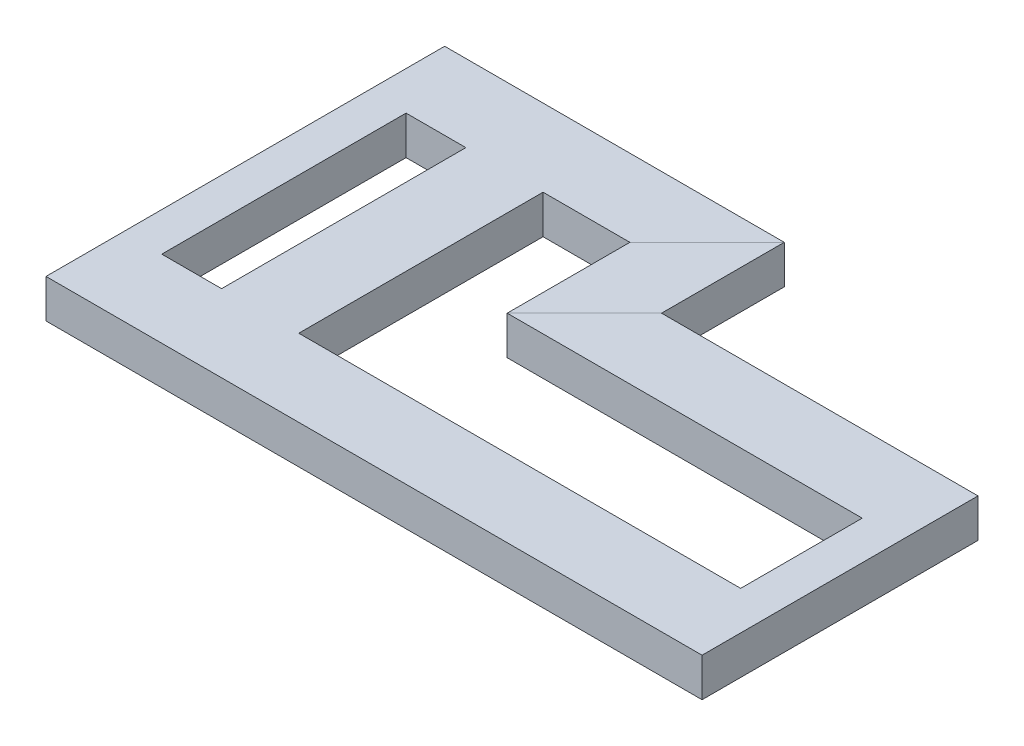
ISO-10303-21;
HEADER;
FILE_DESCRIPTION(('STEP AP214'),'2;1');
FILE_NAME('part.step','',(''),(''),'','','');
FILE_SCHEMA(('AUTOMOTIVE_DESIGN { 1 0 10303 214 1 1 1 1 }'));
ENDSEC;
DATA;
#1=APPLICATION_CONTEXT('core data for automotive mechanical design processes');
#2=APPLICATION_PROTOCOL_DEFINITION('international standard','automotive_design',2000,#1);
#3=PRODUCT_CONTEXT('',#1,'mechanical');
#4=PRODUCT('Part','Part','',(#3));
#5=PRODUCT_RELATED_PRODUCT_CATEGORY('part','',(#4));
#6=PRODUCT_DEFINITION_FORMATION('','',#4);
#7=PRODUCT_DEFINITION_CONTEXT('part definition',#1,'design');
#8=PRODUCT_DEFINITION('design','',#6,#7);
#9=PRODUCT_DEFINITION_SHAPE('','',#8);
#10=(LENGTH_UNIT() NAMED_UNIT(*) SI_UNIT(.MILLI.,.METRE.));
#11=(NAMED_UNIT(*) PLANE_ANGLE_UNIT() SI_UNIT($,.RADIAN.));
#12=(NAMED_UNIT(*) SI_UNIT($,.STERADIAN.) SOLID_ANGLE_UNIT());
#13=UNCERTAINTY_MEASURE_WITH_UNIT(LENGTH_MEASURE(1.E-05),#10,'distance_accuracy_value','');
#14=(GEOMETRIC_REPRESENTATION_CONTEXT(3) GLOBAL_UNCERTAINTY_ASSIGNED_CONTEXT((#13)) GLOBAL_UNIT_ASSIGNED_CONTEXT((#10,
#11,#12)) REPRESENTATION_CONTEXT('',''));
#15=CARTESIAN_POINT('',(0.,0.,0.));
#16=DIRECTION('',(0.,0.,1.));
#17=DIRECTION('',(1.,0.,0.));
#18=AXIS2_PLACEMENT_3D('',#15,#16,#17);
#19=CARTESIAN_POINT('',(-1700.,-100.,-100.));
#20=DIRECTION('',(0.,0.,-1.));
#21=DIRECTION('',(-1.,0.,0.));
#22=AXIS2_PLACEMENT_3D('',#19,#20,#21);
#23=PLANE('',#22);
#24=DIRECTION('',(1.,0.,0.));
#25=VECTOR('',#24,1.);
#26=CARTESIAN_POINT('',(-1700.,-100.,-100.));
#27=LINE('',#26,#25);
#28=CARTESIAN_POINT('',(-1245.,-100.,-100.));
#29=VERTEX_POINT('',#28);
#30=CARTESIAN_POINT('',(-100.,-100.,-99.9999999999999));
#31=VERTEX_POINT('',#30);
#32=EDGE_CURVE('E605',#29,#31,#27,.T.);
#33=ORIENTED_EDGE('',*,*,#32,.F.);
#34=DIRECTION('',(0.,-1.,0.));
#35=VECTOR('',#34,1.);
#36=CARTESIAN_POINT('',(-1245.,0.,-100.));
#37=LINE('',#36,#35);
#38=CARTESIAN_POINT('',(-1245.,0.,-100.));
#39=VERTEX_POINT('',#38);
#40=EDGE_CURVE('E53',#39,#29,#37,.T.);
#41=ORIENTED_EDGE('',*,*,#40,.F.);
#42=DIRECTION('',(1.,0.,0.));
#43=VECTOR('',#42,1.);
#44=CARTESIAN_POINT('',(-1700.,0.,-100.));
#45=LINE('',#44,#43);
#46=CARTESIAN_POINT('',(-100.,0.,-100.));
#47=VERTEX_POINT('',#46);
#48=EDGE_CURVE('E600',#39,#47,#45,.T.);
#49=ORIENTED_EDGE('',*,*,#48,.T.);
#50=DIRECTION('',(0.,1.,0.));
#51=VECTOR('',#50,1.);
#52=CARTESIAN_POINT('',(-100.,-100.,-100.));
#53=LINE('',#52,#51);
#54=EDGE_CURVE('E388',#31,#47,#53,.T.);
#55=ORIENTED_EDGE('',*,*,#54,.F.);
#56=EDGE_LOOP('',(#33,#41,#49,#55));
#57=FACE_BOUND('',#56,.T.);
#58=ADVANCED_FACE('F35',(#57),#23,.T.);
#59=CARTESIAN_POINT('',(-1600.,0.,-100.));
#60=VERTEX_POINT('',#59);
#61=CARTESIAN_POINT('',(-1445.,0.,-100.));
#62=VERTEX_POINT('',#61);
#63=EDGE_CURVE('E598',#60,#62,#45,.T.);
#64=ORIENTED_EDGE('',*,*,#63,.T.);
#65=DIRECTION('',(0.,1.,0.));
#66=VECTOR('',#65,1.);
#67=CARTESIAN_POINT('',(-1445.,-100.,-100.));
#68=LINE('',#67,#66);
#69=CARTESIAN_POINT('',(-1445.,-100.,-100.));
#70=VERTEX_POINT('',#69);
#71=EDGE_CURVE('E320',#70,#62,#68,.T.);
#72=ORIENTED_EDGE('',*,*,#71,.F.);
#73=CARTESIAN_POINT('',(-1600.,-100.,-100.));
#74=VERTEX_POINT('',#73);
#75=EDGE_CURVE('E601',#74,#70,#27,.T.);
#76=ORIENTED_EDGE('',*,*,#75,.F.);
#77=DIRECTION('',(0.,1.,0.));
#78=VECTOR('',#77,1.);
#79=CARTESIAN_POINT('',(-1600.,0.,-100.));
#80=LINE('',#79,#78);
#81=EDGE_CURVE('E547',#74,#60,#80,.T.);
#82=ORIENTED_EDGE('',*,*,#81,.T.);
#83=EDGE_LOOP('',(#64,#72,#76,#82));
#84=FACE_BOUND('',#83,.T.);
#85=ADVANCED_FACE('F645',(#84),#23,.T.);
#86=DIRECTION('',(-1.,0.,0.));
#87=VECTOR('',#86,1.);
#88=CARTESIAN_POINT('',(-1435.,-10.,-100.));
#89=LINE('',#88,#87);
#90=CARTESIAN_POINT('',(-1255.,-10.,-100.));
#91=VERTEX_POINT('',#90);
#92=CARTESIAN_POINT('',(-1435.,-10.,-100.));
#93=VERTEX_POINT('',#92);
#94=EDGE_CURVE('E806',#91,#93,#89,.T.);
#95=ORIENTED_EDGE('',*,*,#94,.F.);
#96=DIRECTION('',(0.,1.,0.));
#97=VECTOR('',#96,1.);
#98=CARTESIAN_POINT('',(-1255.,-10.,-100.));
#99=LINE('',#98,#97);
#100=CARTESIAN_POINT('',(-1255.,-100.,-100.));
#101=VERTEX_POINT('',#100);
#102=EDGE_CURVE('E802',#101,#91,#99,.T.);
#103=ORIENTED_EDGE('',*,*,#102,.F.);
#104=CARTESIAN_POINT('',(-1435.,-100.,-100.));
#105=VERTEX_POINT('',#104);
#106=EDGE_CURVE('E604',#105,#101,#27,.T.);
#107=ORIENTED_EDGE('',*,*,#106,.F.);
#108=DIRECTION('',(0.,-1.,0.));
#109=VECTOR('',#108,1.);
#110=CARTESIAN_POINT('',(-1435.,-100.,-100.));
#111=LINE('',#110,#109);
#112=EDGE_CURVE('E809',#93,#105,#111,.T.);
#113=ORIENTED_EDGE('',*,*,#112,.F.);
#114=EDGE_LOOP('',(#95,#103,#107,#113));
#115=FACE_BOUND('',#114,.T.);
#116=ADVANCED_FACE('F652',(#115),#23,.T.);
#117=CARTESIAN_POINT('',(-820.,-100.,-733.));
#118=DIRECTION('',(0.,0.,-1.));
#119=DIRECTION('',(-1.,0.,0.));
#120=AXIS2_PLACEMENT_3D('',#117,#118,#119);
#121=PLANE('',#120);
#122=DIRECTION('',(0.,-1.,0.));
#123=VECTOR('',#122,1.);
#124=CARTESIAN_POINT('',(-1245.,0.,-733.000000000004));
#125=LINE('',#124,#123);
#126=CARTESIAN_POINT('',(-1245.,0.,-733.));
#127=VERTEX_POINT('',#126);
#128=CARTESIAN_POINT('',(-1245.,-100.,-733.));
#129=VERTEX_POINT('',#128);
#130=EDGE_CURVE('E316',#127,#129,#125,.T.);
#131=ORIENTED_EDGE('',*,*,#130,.T.);
#132=DIRECTION('',(-1.,0.,0.));
#133=VECTOR('',#132,1.);
#134=CARTESIAN_POINT('',(-820.,-100.,-733.));
#135=LINE('',#134,#133);
#136=CARTESIAN_POINT('',(-1020.,-100.,-733.));
#137=VERTEX_POINT('',#136);
#138=EDGE_CURVE('E497',#137,#129,#135,.T.);
#139=ORIENTED_EDGE('',*,*,#138,.F.);
#140=DIRECTION('',(0.,1.,0.));
#141=VECTOR('',#140,1.);
#142=CARTESIAN_POINT('',(-1020.,-100.,-733.));
#143=LINE('',#142,#141);
#144=CARTESIAN_POINT('',(-1020.,0.,-733.));
#145=VERTEX_POINT('',#144);
#146=EDGE_CURVE('E479',#137,#145,#143,.T.);
#147=ORIENTED_EDGE('',*,*,#146,.T.);
#148=DIRECTION('',(-1.,0.,0.));
#149=VECTOR('',#148,1.);
#150=CARTESIAN_POINT('',(-820.,0.,-733.));
#151=LINE('',#150,#149);
#152=EDGE_CURVE('E306',#145,#127,#151,.T.);
#153=ORIENTED_EDGE('',*,*,#152,.T.);
#154=EDGE_LOOP('',(#131,#139,#147,#153));
#155=FACE_BOUND('',#154,.T.);
#156=ADVANCED_FACE('F760',(#155),#121,.F.);
#157=DIRECTION('',(0.,1.,0.));
#158=VECTOR('',#157,1.);
#159=CARTESIAN_POINT('',(-1445.,-100.,-733.000000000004));
#160=LINE('',#159,#158);
#161=CARTESIAN_POINT('',(-1445.,-100.,-733.));
#162=VERTEX_POINT('',#161);
#163=CARTESIAN_POINT('',(-1445.,0.,-733.000000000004));
#164=VERTEX_POINT('',#163);
#165=EDGE_CURVE('E310',#162,#164,#160,.T.);
#166=ORIENTED_EDGE('',*,*,#165,.T.);
#167=CARTESIAN_POINT('',(-1600.,0.,-733.));
#168=VERTEX_POINT('',#167);
#169=EDGE_CURVE('E295',#164,#168,#151,.T.);
#170=ORIENTED_EDGE('',*,*,#169,.T.);
#171=DIRECTION('',(0.,-1.,0.));
#172=VECTOR('',#171,1.);
#173=CARTESIAN_POINT('',(-1600.,0.,-733.));
#174=LINE('',#173,#172);
#175=CARTESIAN_POINT('',(-1600.,-100.,-733.));
#176=VERTEX_POINT('',#175);
#177=EDGE_CURVE('E566',#168,#176,#174,.T.);
#178=ORIENTED_EDGE('',*,*,#177,.T.);
#179=EDGE_CURVE('E312',#162,#176,#135,.T.);
#180=ORIENTED_EDGE('',*,*,#179,.F.);
#181=EDGE_LOOP('',(#166,#170,#178,#180));
#182=FACE_BOUND('',#181,.T.);
#183=ADVANCED_FACE('F311',(#182),#121,.F.);
#184=DIRECTION('',(0.,1.,0.));
#185=VECTOR('',#184,1.);
#186=CARTESIAN_POINT('',(-1255.,-10.,-733.000000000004));
#187=LINE('',#186,#185);
#188=CARTESIAN_POINT('',(-1255.,-100.,-733.));
#189=VERTEX_POINT('',#188);
#190=CARTESIAN_POINT('',(-1255.,-9.99999999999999,-733.));
#191=VERTEX_POINT('',#190);
#192=EDGE_CURVE('E61',#189,#191,#187,.T.);
#193=ORIENTED_EDGE('',*,*,#192,.T.);
#194=DIRECTION('',(-1.,0.,0.));
#195=VECTOR('',#194,1.);
#196=CARTESIAN_POINT('',(-1434.99999999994,-10.,-733.000000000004));
#197=LINE('',#196,#195);
#198=CARTESIAN_POINT('',(-1435.,-10.,-733.));
#199=VERTEX_POINT('',#198);
#200=EDGE_CURVE('E331',#191,#199,#197,.T.);
#201=ORIENTED_EDGE('',*,*,#200,.T.);
#202=DIRECTION('',(0.,-1.,0.));
#203=VECTOR('',#202,1.);
#204=CARTESIAN_POINT('',(-1435.,-100.,-733.000000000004));
#205=LINE('',#204,#203);
#206=CARTESIAN_POINT('',(-1435.,-100.,-733.));
#207=VERTEX_POINT('',#206);
#208=EDGE_CURVE('E333',#199,#207,#205,.T.);
#209=ORIENTED_EDGE('',*,*,#208,.T.);
#210=EDGE_CURVE('E536',#189,#207,#135,.T.);
#211=ORIENTED_EDGE('',*,*,#210,.F.);
#212=EDGE_LOOP('',(#193,#201,#209,#211));
#213=FACE_BOUND('',#212,.T.);
#214=ADVANCED_FACE('F944',(#213),#121,.F.);
#215=CARTESIAN_POINT('',(-1700.,-100.,-90.));
#216=DIRECTION('',(0.,0.,1.));
#217=DIRECTION('',(1.,0.,0.));
#218=AXIS2_PLACEMENT_3D('',#215,#216,#217);
#219=PLANE('',#218);
#220=DIRECTION('',(0.,1.,0.));
#221=VECTOR('',#220,1.);
#222=CARTESIAN_POINT('',(-5.,-10.,-90.));
#223=LINE('',#222,#221);
#224=CARTESIAN_POINT('',(-5.,-100.,-90.));
#225=VERTEX_POINT('',#224);
#226=CARTESIAN_POINT('',(-5.,-10.,-90.));
#227=VERTEX_POINT('',#226);
#228=EDGE_CURVE('E335',#225,#227,#223,.T.);
#229=ORIENTED_EDGE('',*,*,#228,.T.);
#230=DIRECTION('',(1.,0.,0.));
#231=VECTOR('',#230,1.);
#232=CARTESIAN_POINT('',(-1700.,-10.,-90.));
#233=LINE('',#232,#231);
#234=CARTESIAN_POINT('',(-1695.,-10.,-90.));
#235=VERTEX_POINT('',#234);
#236=EDGE_CURVE('E609',#235,#227,#233,.T.);
#237=ORIENTED_EDGE('',*,*,#236,.F.);
#238=DIRECTION('',(0.,1.,0.));
#239=VECTOR('',#238,1.);
#240=CARTESIAN_POINT('',(-1695.,-100.,-90.));
#241=LINE('',#240,#239);
#242=CARTESIAN_POINT('',(-1695.,-100.,-90.));
#243=VERTEX_POINT('',#242);
#244=EDGE_CURVE('E362',#243,#235,#241,.T.);
#245=ORIENTED_EDGE('',*,*,#244,.F.);
#246=DIRECTION('',(1.,0.,0.));
#247=VECTOR('',#246,1.);
#248=CARTESIAN_POINT('',(-1700.,-100.,-90.));
#249=LINE('',#248,#247);
#250=EDGE_CURVE('E606',#243,#225,#249,.T.);
#251=ORIENTED_EDGE('',*,*,#250,.T.);
#252=EDGE_LOOP('',(#229,#237,#245,#251));
#253=FACE_BOUND('',#252,.T.);
#254=ADVANCED_FACE('F628',(#253),#219,.T.);
#255=CARTESIAN_POINT('',(-1700.,-10.,90.));
#256=DIRECTION('',(0.,-1.,0.));
#257=DIRECTION('',(0.,0.,-1.));
#258=AXIS2_PLACEMENT_3D('',#255,#256,#257);
#259=PLANE('',#258);
#260=DIRECTION('',(0.,0.,1.));
#261=VECTOR('',#260,1.);
#262=CARTESIAN_POINT('',(-5.,-10.,-90.));
#263=LINE('',#262,#261);
#264=CARTESIAN_POINT('',(-5.,-10.,90.));
#265=VERTEX_POINT('',#264);
#266=EDGE_CURVE('E338',#227,#265,#263,.T.);
#267=ORIENTED_EDGE('',*,*,#266,.T.);
#268=DIRECTION('',(1.,0.,0.));
#269=VECTOR('',#268,1.);
#270=CARTESIAN_POINT('',(-1700.,-10.,90.));
#271=LINE('',#270,#269);
#272=CARTESIAN_POINT('',(-1695.,-10.,90.));
#273=VERTEX_POINT('',#272);
#274=EDGE_CURVE('E611',#273,#265,#271,.T.);
#275=ORIENTED_EDGE('',*,*,#274,.F.);
#276=DIRECTION('',(0.,0.,-1.));
#277=VECTOR('',#276,1.);
#278=CARTESIAN_POINT('',(-1695.,-10.,90.));
#279=LINE('',#278,#277);
#280=EDGE_CURVE('E365',#273,#235,#279,.T.);
#281=ORIENTED_EDGE('',*,*,#280,.T.);
#282=ORIENTED_EDGE('',*,*,#236,.T.);
#283=EDGE_LOOP('',(#267,#275,#281,#282));
#284=FACE_BOUND('',#283,.T.);
#285=ADVANCED_FACE('F624',(#284),#259,.T.);
#286=CARTESIAN_POINT('',(-1700.,-100.,90.));
#287=DIRECTION('',(0.,0.,-1.));
#288=DIRECTION('',(-1.,0.,0.));
#289=AXIS2_PLACEMENT_3D('',#286,#287,#288);
#290=PLANE('',#289);
#291=DIRECTION('',(0.,-1.,0.));
#292=VECTOR('',#291,1.);
#293=CARTESIAN_POINT('',(-5.,-10.,90.));
#294=LINE('',#293,#292);
#295=CARTESIAN_POINT('',(-5.,-100.,90.));
#296=VERTEX_POINT('',#295);
#297=EDGE_CURVE('E341',#265,#296,#294,.T.);
#298=ORIENTED_EDGE('',*,*,#297,.T.);
#299=DIRECTION('',(1.,0.,0.));
#300=VECTOR('',#299,1.);
#301=CARTESIAN_POINT('',(-1700.,-100.,90.));
#302=LINE('',#301,#300);
#303=CARTESIAN_POINT('',(-1695.,-100.,90.));
#304=VERTEX_POINT('',#303);
#305=EDGE_CURVE('E39',#304,#296,#302,.T.);
#306=ORIENTED_EDGE('',*,*,#305,.F.);
#307=DIRECTION('',(0.,1.,0.));
#308=VECTOR('',#307,1.);
#309=CARTESIAN_POINT('',(-1695.,-100.,90.));
#310=LINE('',#309,#308);
#311=EDGE_CURVE('E367',#304,#273,#310,.T.);
#312=ORIENTED_EDGE('',*,*,#311,.T.);
#313=ORIENTED_EDGE('',*,*,#274,.T.);
#314=EDGE_LOOP('',(#298,#306,#312,#313));
#315=FACE_BOUND('',#314,.T.);
#316=ADVANCED_FACE('F37',(#315),#290,.T.);
#317=CARTESIAN_POINT('',(-820.,-100.,-743.));
#318=DIRECTION('',(0.,0.,1.));
#319=DIRECTION('',(1.,0.,0.));
#320=AXIS2_PLACEMENT_3D('',#317,#318,#319);
#321=PLANE('',#320);
#322=DIRECTION('',(0.,1.,0.));
#323=VECTOR('',#322,1.);
#324=CARTESIAN_POINT('',(-1695.,-100.,-743.));
#325=LINE('',#324,#323);
#326=CARTESIAN_POINT('',(-1695.,-100.,-743.));
#327=VERTEX_POINT('',#326);
#328=CARTESIAN_POINT('',(-1695.,-10.,-743.));
#329=VERTEX_POINT('',#328);
#330=EDGE_CURVE('E369',#327,#329,#325,.T.);
#331=ORIENTED_EDGE('',*,*,#330,.T.);
#332=DIRECTION('',(-1.,0.,0.));
#333=VECTOR('',#332,1.);
#334=CARTESIAN_POINT('',(-820.,-10.,-743.));
#335=LINE('',#334,#333);
#336=CARTESIAN_POINT('',(-1010.,-10.,-743.));
#337=VERTEX_POINT('',#336);
#338=EDGE_CURVE('E528',#337,#329,#335,.T.);
#339=ORIENTED_EDGE('',*,*,#338,.F.);
#340=DIRECTION('',(0.,-1.,0.));
#341=VECTOR('',#340,1.);
#342=CARTESIAN_POINT('',(-1010.,-100.,-743.));
#343=LINE('',#342,#341);
#344=CARTESIAN_POINT('',(-1010.,-100.,-743.));
#345=VERTEX_POINT('',#344);
#346=EDGE_CURVE('E485',#337,#345,#343,.T.);
#347=ORIENTED_EDGE('',*,*,#346,.T.);
#348=DIRECTION('',(-1.,0.,0.));
#349=VECTOR('',#348,1.);
#350=CARTESIAN_POINT('',(-820.,-100.,-743.));
#351=LINE('',#350,#349);
#352=EDGE_CURVE('E531',#345,#327,#351,.T.);
#353=ORIENTED_EDGE('',*,*,#352,.T.);
#354=EDGE_LOOP('',(#331,#339,#347,#353));
#355=FACE_BOUND('',#354,.T.);
#356=ADVANCED_FACE('F748',(#355),#321,.F.);
#357=CARTESIAN_POINT('',(-820.,-10.,-743.));
#358=DIRECTION('',(0.,1.,0.));
#359=DIRECTION('',(0.,0.,1.));
#360=AXIS2_PLACEMENT_3D('',#357,#358,#359);
#361=PLANE('',#360);
#362=DIRECTION('',(0.,0.,-1.));
#363=VECTOR('',#362,1.);
#364=CARTESIAN_POINT('',(-1695.,-10.,-743.));
#365=LINE('',#364,#363);
#366=CARTESIAN_POINT('',(-1695.,-10.,-923.));
#367=VERTEX_POINT('',#366);
#368=EDGE_CURVE('E372',#329,#367,#365,.T.);
#369=ORIENTED_EDGE('',*,*,#368,.T.);
#370=DIRECTION('',(-1.,0.,0.));
#371=VECTOR('',#370,1.);
#372=CARTESIAN_POINT('',(-820.,-10.,-923.));
#373=LINE('',#372,#371);
#374=CARTESIAN_POINT('',(-830.,-10.,-923.));
#375=VERTEX_POINT('',#374);
#376=EDGE_CURVE('E525',#375,#367,#373,.T.);
#377=ORIENTED_EDGE('',*,*,#376,.F.);
#378=DIRECTION('',(-0.707106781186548,0.,0.707106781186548));
#379=VECTOR('',#378,1.);
#380=CARTESIAN_POINT('',(-1184.05,-10.,-568.95));
#381=LINE('',#380,#379);
#382=EDGE_CURVE('E482',#375,#337,#381,.T.);
#383=ORIENTED_EDGE('',*,*,#382,.T.);
#384=ORIENTED_EDGE('',*,*,#338,.T.);
#385=EDGE_LOOP('',(#369,#377,#383,#384));
#386=FACE_BOUND('',#385,.T.);
#387=ADVANCED_FACE('F751',(#386),#361,.F.);
#388=CARTESIAN_POINT('',(-820.,-10.,-923.));
#389=DIRECTION('',(0.,0.,-1.));
#390=DIRECTION('',(-1.,0.,0.));
#391=AXIS2_PLACEMENT_3D('',#388,#389,#390);
#392=PLANE('',#391);
#393=DIRECTION('',(0.,1.,0.));
#394=VECTOR('',#393,1.);
#395=CARTESIAN_POINT('',(-1695.,-100.,-923.));
#396=LINE('',#395,#394);
#397=CARTESIAN_POINT('',(-1695.,-100.,-923.));
#398=VERTEX_POINT('',#397);
#399=EDGE_CURVE('E375',#398,#367,#396,.T.);
#400=ORIENTED_EDGE('',*,*,#399,.F.);
#401=DIRECTION('',(-1.,0.,0.));
#402=VECTOR('',#401,1.);
#403=CARTESIAN_POINT('',(-820.,-100.,-923.));
#404=LINE('',#403,#402);
#405=CARTESIAN_POINT('',(-830.,-100.,-923.));
#406=VERTEX_POINT('',#405);
#407=EDGE_CURVE('E521',#406,#398,#404,.T.);
#408=ORIENTED_EDGE('',*,*,#407,.F.);
#409=DIRECTION('',(0.,1.,0.));
#410=VECTOR('',#409,1.);
#411=CARTESIAN_POINT('',(-830.,-10.,-923.));
#412=LINE('',#411,#410);
#413=EDGE_CURVE('E478',#406,#375,#412,.T.);
#414=ORIENTED_EDGE('',*,*,#413,.T.);
#415=ORIENTED_EDGE('',*,*,#376,.T.);
#416=EDGE_LOOP('',(#400,#408,#414,#415));
#417=FACE_BOUND('',#416,.T.);
#418=ADVANCED_FACE('F755',(#417),#392,.F.);
#419=CARTESIAN_POINT('',(0.,-100.,-415.));
#420=DIRECTION('',(0.,0.,-1.));
#421=DIRECTION('',(-1.,0.,0.));
#422=AXIS2_PLACEMENT_3D('',#419,#420,#421);
#423=PLANE('',#422);
#424=DIRECTION('',(0.,-1.,0.));
#425=VECTOR('',#424,1.);
#426=CARTESIAN_POINT('',(-100.,-100.,-415.));
#427=LINE('',#426,#425);
#428=CARTESIAN_POINT('',(-100.,0.,-415.));
#429=VERTEX_POINT('',#428);
#430=CARTESIAN_POINT('',(-100.,-100.,-415.));
#431=VERTEX_POINT('',#430);
#432=EDGE_CURVE('E380',#429,#431,#427,.T.);
#433=ORIENTED_EDGE('',*,*,#432,.F.);
#434=DIRECTION('',(-1.,0.,0.));
#435=VECTOR('',#434,1.);
#436=CARTESIAN_POINT('',(0.,0.,-415.));
#437=LINE('',#436,#435);
#438=CARTESIAN_POINT('',(-1020.,0.,-415.));
#439=VERTEX_POINT('',#438);
#440=EDGE_CURVE('E462',#429,#439,#437,.T.);
#441=ORIENTED_EDGE('',*,*,#440,.T.);
#442=DIRECTION('',(0.,1.,0.));
#443=VECTOR('',#442,1.);
#444=CARTESIAN_POINT('',(-1020.,-100.,-415.));
#445=LINE('',#444,#443);
#446=CARTESIAN_POINT('',(-1020.,-100.,-415.));
#447=VERTEX_POINT('',#446);
#448=EDGE_CURVE('E438',#447,#439,#445,.T.);
#449=ORIENTED_EDGE('',*,*,#448,.F.);
#450=DIRECTION('',(-1.,0.,0.));
#451=VECTOR('',#450,1.);
#452=CARTESIAN_POINT('',(0.,-100.,-415.));
#453=LINE('',#452,#451);
#454=EDGE_CURVE('E445',#431,#447,#453,.T.);
#455=ORIENTED_EDGE('',*,*,#454,.F.);
#456=EDGE_LOOP('',(#433,#441,#449,#455));
#457=FACE_BOUND('',#456,.T.);
#458=ADVANCED_FACE('F712',(#457),#423,.F.);
#459=CARTESIAN_POINT('',(-1700.,-100.,100.));
#460=DIRECTION('',(0.,0.,1.));
#461=DIRECTION('',(1.,0.,0.));
#462=AXIS2_PLACEMENT_3D('',#459,#460,#461);
#463=PLANE('',#462);
#464=DIRECTION('',(0.,-1.,0.));
#465=VECTOR('',#464,1.);
#466=CARTESIAN_POINT('',(0.,-100.,100.));
#467=LINE('',#466,#465);
#468=CARTESIAN_POINT('',(0.,0.,100.));
#469=VERTEX_POINT('',#468);
#470=CARTESIAN_POINT('',(0.,-100.,100.));
#471=VERTEX_POINT('',#470);
#472=EDGE_CURVE('E585',#469,#471,#467,.T.);
#473=ORIENTED_EDGE('',*,*,#472,.F.);
#474=DIRECTION('',(1.,0.,0.));
#475=VECTOR('',#474,1.);
#476=CARTESIAN_POINT('',(-1700.,0.,100.));
#477=LINE('',#476,#475);
#478=CARTESIAN_POINT('',(-1700.,0.,100.));
#479=VERTEX_POINT('',#478);
#480=EDGE_CURVE('E45',#479,#469,#477,.T.);
#481=ORIENTED_EDGE('',*,*,#480,.F.);
#482=DIRECTION('',(0.,-1.,0.));
#483=VECTOR('',#482,1.);
#484=CARTESIAN_POINT('',(-1700.,-100.,100.));
#485=LINE('',#484,#483);
#486=CARTESIAN_POINT('',(-1700.,-100.,100.));
#487=VERTEX_POINT('',#486);
#488=EDGE_CURVE('E588',#479,#487,#485,.T.);
#489=ORIENTED_EDGE('',*,*,#488,.T.);
#490=DIRECTION('',(1.,0.,0.));
#491=VECTOR('',#490,1.);
#492=CARTESIAN_POINT('',(-1700.,-100.,100.));
#493=LINE('',#492,#491);
#494=EDGE_CURVE('E11',#487,#471,#493,.T.);
#495=ORIENTED_EDGE('',*,*,#494,.T.);
#496=EDGE_LOOP('',(#473,#481,#489,#495));
#497=FACE_BOUND('',#496,.T.);
#498=ADVANCED_FACE('F787',(#497),#463,.T.);
#499=CARTESIAN_POINT('',(-1700.,0.,100.));
#500=DIRECTION('',(0.,1.,0.));
#501=DIRECTION('',(0.,0.,1.));
#502=AXIS2_PLACEMENT_3D('',#499,#500,#501);
#503=PLANE('',#502);
#504=ORIENTED_EDGE('',*,*,#48,.F.);
#505=DIRECTION('',(0.,0.,1.));
#506=VECTOR('',#505,1.);
#507=CARTESIAN_POINT('',(-1245.,0.,-500000.));
#508=LINE('',#507,#506);
#509=EDGE_CURVE('E322',#127,#39,#508,.T.);
#510=ORIENTED_EDGE('',*,*,#509,.F.);
#511=ORIENTED_EDGE('',*,*,#152,.F.);
#512=DIRECTION('',(0.707106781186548,0.,-0.707106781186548));
#513=VECTOR('',#512,1.);
#514=CARTESIAN_POINT('',(-1189.05,0.,-563.95));
#515=LINE('',#514,#513);
#516=CARTESIAN_POINT('',(-820.,0.,-933.));
#517=VERTEX_POINT('',#516);
#518=EDGE_CURVE('E494',#145,#517,#515,.T.);
#519=ORIENTED_EDGE('',*,*,#518,.T.);
#520=DIRECTION('',(-1.,0.,0.));
#521=VECTOR('',#520,1.);
#522=CARTESIAN_POINT('',(-820.,0.,-933.));
#523=LINE('',#522,#521);
#524=CARTESIAN_POINT('',(-1700.,0.,-933.));
#525=VERTEX_POINT('',#524);
#526=EDGE_CURVE('E513',#517,#525,#523,.T.);
#527=ORIENTED_EDGE('',*,*,#526,.T.);
#528=DIRECTION('',(0.,0.,1.));
#529=VECTOR('',#528,1.);
#530=CARTESIAN_POINT('',(-1700.,0.,100.));
#531=LINE('',#530,#529);
#532=EDGE_CURVE('E584',#525,#479,#531,.T.);
#533=ORIENTED_EDGE('',*,*,#532,.T.);
#534=ORIENTED_EDGE('',*,*,#480,.T.);
#535=DIRECTION('',(0.,0.,1.));
#536=VECTOR('',#535,1.);
#537=CARTESIAN_POINT('',(0.,0.,100.));
#538=LINE('',#537,#536);
#539=CARTESIAN_POINT('',(0.,0.,-615.));
#540=VERTEX_POINT('',#539);
#541=EDGE_CURVE('E592',#540,#469,#538,.T.);
#542=ORIENTED_EDGE('',*,*,#541,.F.);
#543=DIRECTION('',(-1.,0.,0.));
#544=VECTOR('',#543,1.);
#545=CARTESIAN_POINT('',(0.,0.,-615.));
#546=LINE('',#545,#544);
#547=CARTESIAN_POINT('',(-820.,0.,-615.));
#548=VERTEX_POINT('',#547);
#549=EDGE_CURVE('E456',#540,#548,#546,.T.);
#550=ORIENTED_EDGE('',*,*,#549,.T.);
#551=DIRECTION('',(0.707106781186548,0.,-0.707106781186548));
#552=VECTOR('',#551,1.);
#553=CARTESIAN_POINT('',(-510.,0.,-925.));
#554=LINE('',#553,#552);
#555=EDGE_CURVE('E435',#439,#548,#554,.T.);
#556=ORIENTED_EDGE('',*,*,#555,.F.);
#557=ORIENTED_EDGE('',*,*,#440,.F.);
#558=DIRECTION('',(0.,0.,-1.));
#559=VECTOR('',#558,1.);
#560=CARTESIAN_POINT('',(-100.,0.,41.4213562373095));
#561=LINE('',#560,#559);
#562=EDGE_CURVE('E384',#47,#429,#561,.T.);
#563=ORIENTED_EDGE('',*,*,#562,.F.);
#564=EDGE_LOOP('',(#504,#510,#511,#519,#527,#533,#534,#542,#550,#556,#557,#563));
#565=FACE_BOUND('',#564,.T.);
#566=DIRECTION('',(0.,0.,1.));
#567=VECTOR('',#566,1.);
#568=CARTESIAN_POINT('',(-1445.,0.,-500000.));
#569=LINE('',#568,#567);
#570=EDGE_CURVE('E300',#164,#62,#569,.T.);
#571=ORIENTED_EDGE('',*,*,#570,.T.);
#572=ORIENTED_EDGE('',*,*,#63,.F.);
#573=DIRECTION('',(0.,0.,-1.));
#574=VECTOR('',#573,1.);
#575=CARTESIAN_POINT('',(-1600.,0.,41.4213562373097));
#576=LINE('',#575,#574);
#577=EDGE_CURVE('E302',#60,#168,#576,.T.);
#578=ORIENTED_EDGE('',*,*,#577,.T.);
#579=ORIENTED_EDGE('',*,*,#169,.F.);
#580=EDGE_LOOP('',(#571,#572,#578,#579));
#581=FACE_BOUND('',#580,.T.);
#582=ADVANCED_FACE('F297',(#565,#581),#503,.T.);
#583=CARTESIAN_POINT('',(-1700.,-100.,-100.));
#584=DIRECTION('',(0.,-1.,0.));
#585=DIRECTION('',(0.,0.,-1.));
#586=AXIS2_PLACEMENT_3D('',#583,#584,#585);
#587=PLANE('',#586);
#588=ORIENTED_EDGE('',*,*,#75,.T.);
#589=DIRECTION('',(0.,0.,1.));
#590=VECTOR('',#589,1.);
#591=CARTESIAN_POINT('',(-1445.,-100.,-500000.));
#592=LINE('',#591,#590);
#593=EDGE_CURVE('E315',#162,#70,#592,.T.);
#594=ORIENTED_EDGE('',*,*,#593,.F.);
#595=ORIENTED_EDGE('',*,*,#179,.T.);
#596=DIRECTION('',(0.,0.,-1.));
#597=VECTOR('',#596,1.);
#598=CARTESIAN_POINT('',(-1600.,-100.,41.4213562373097));
#599=LINE('',#598,#597);
#600=EDGE_CURVE('E576',#74,#176,#599,.T.);
#601=ORIENTED_EDGE('',*,*,#600,.F.);
#602=EDGE_LOOP('',(#588,#594,#595,#601));
#603=FACE_BOUND('',#602,.T.);
#604=ORIENTED_EDGE('',*,*,#106,.T.);
#605=DIRECTION('',(0.,0.,1.));
#606=VECTOR('',#605,1.);
#607=CARTESIAN_POINT('',(-1255.,-100.,-500000.));
#608=LINE('',#607,#606);
#609=EDGE_CURVE('E817',#189,#101,#608,.T.);
#610=ORIENTED_EDGE('',*,*,#609,.F.);
#611=ORIENTED_EDGE('',*,*,#210,.T.);
#612=DIRECTION('',(0.,0.,1.));
#613=VECTOR('',#612,1.);
#614=CARTESIAN_POINT('',(-1435.,-100.,-500000.));
#615=LINE('',#614,#613);
#616=EDGE_CURVE('E811',#207,#105,#615,.T.);
#617=ORIENTED_EDGE('',*,*,#616,.T.);
#618=EDGE_LOOP('',(#604,#610,#611,#617));
#619=FACE_BOUND('',#618,.T.);
#620=DIRECTION('',(0.,0.,-1.));
#621=VECTOR('',#620,1.);
#622=CARTESIAN_POINT('',(0.,-100.,-100.));
#623=LINE('',#622,#621);
#624=CARTESIAN_POINT('',(0.,-100.,-615.));
#625=VERTEX_POINT('',#624);
#626=EDGE_CURVE('E540',#471,#625,#623,.T.);
#627=ORIENTED_EDGE('',*,*,#626,.F.);
#628=ORIENTED_EDGE('',*,*,#494,.F.);
#629=DIRECTION('',(0.,0.,-1.));
#630=VECTOR('',#629,1.);
#631=CARTESIAN_POINT('',(-1700.,-100.,100.));
#632=LINE('',#631,#630);
#633=CARTESIAN_POINT('',(-1700.,-100.,-933.));
#634=VERTEX_POINT('',#633);
#635=EDGE_CURVE('E582',#487,#634,#632,.T.);
#636=ORIENTED_EDGE('',*,*,#635,.T.);
#637=DIRECTION('',(-1.,0.,0.));
#638=VECTOR('',#637,1.);
#639=CARTESIAN_POINT('',(-820.,-100.,-933.));
#640=LINE('',#639,#638);
#641=CARTESIAN_POINT('',(-820.,-100.,-933.));
#642=VERTEX_POINT('',#641);
#643=EDGE_CURVE('E519',#642,#634,#640,.T.);
#644=ORIENTED_EDGE('',*,*,#643,.F.);
#645=DIRECTION('',(-0.707106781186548,0.,0.707106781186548));
#646=VECTOR('',#645,1.);
#647=CARTESIAN_POINT('',(-1094.05,-100.,-658.95));
#648=LINE('',#647,#646);
#649=EDGE_CURVE('E475',#642,#406,#648,.T.);
#650=ORIENTED_EDGE('',*,*,#649,.T.);
#651=ORIENTED_EDGE('',*,*,#407,.T.);
#652=DIRECTION('',(0.,0.,-1.));
#653=VECTOR('',#652,1.);
#654=CARTESIAN_POINT('',(-1695.,-100.,-743.));
#655=LINE('',#654,#653);
#656=EDGE_CURVE('E377',#327,#398,#655,.T.);
#657=ORIENTED_EDGE('',*,*,#656,.F.);
#658=ORIENTED_EDGE('',*,*,#352,.F.);
#659=DIRECTION('',(-0.707106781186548,0.,0.707106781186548));
#660=VECTOR('',#659,1.);
#661=CARTESIAN_POINT('',(-1189.05,-100.,-563.95));
#662=LINE('',#661,#660);
#663=EDGE_CURVE('E488',#345,#137,#662,.T.);
#664=ORIENTED_EDGE('',*,*,#663,.T.);
#665=ORIENTED_EDGE('',*,*,#138,.T.);
#666=DIRECTION('',(0.,0.,1.));
#667=VECTOR('',#666,1.);
#668=CARTESIAN_POINT('',(-1245.,-100.,-500000.));
#669=LINE('',#668,#667);
#670=EDGE_CURVE('E324',#129,#29,#669,.T.);
#671=ORIENTED_EDGE('',*,*,#670,.T.);
#672=ORIENTED_EDGE('',*,*,#32,.T.);
#673=DIRECTION('',(0.,0.,-1.));
#674=VECTOR('',#673,1.);
#675=CARTESIAN_POINT('',(-100.,-100.,41.4213562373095));
#676=LINE('',#675,#674);
#677=EDGE_CURVE('E383',#31,#431,#676,.T.);
#678=ORIENTED_EDGE('',*,*,#677,.T.);
#679=ORIENTED_EDGE('',*,*,#454,.T.);
#680=DIRECTION('',(-0.707106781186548,0.,0.707106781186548));
#681=VECTOR('',#680,1.);
#682=CARTESIAN_POINT('',(-510.,-100.,-925.));
#683=LINE('',#682,#681);
#684=CARTESIAN_POINT('',(-1010.,-100.,-425.));
#685=VERTEX_POINT('',#684);
#686=EDGE_CURVE('E441',#685,#447,#683,.T.);
#687=ORIENTED_EDGE('',*,*,#686,.F.);
#688=DIRECTION('',(-1.,0.,0.));
#689=VECTOR('',#688,1.);
#690=CARTESIAN_POINT('',(0.,-100.,-425.));
#691=LINE('',#690,#689);
#692=CARTESIAN_POINT('',(-5.,-100.,-425.));
#693=VERTEX_POINT('',#692);
#694=EDGE_CURVE('E442',#693,#685,#691,.T.);
#695=ORIENTED_EDGE('',*,*,#694,.F.);
#696=DIRECTION('',(0.,0.,-1.));
#697=VECTOR('',#696,1.);
#698=CARTESIAN_POINT('',(-5.,-100.,-425.));
#699=LINE('',#698,#697);
#700=CARTESIAN_POINT('',(-5.,-100.,-605.));
#701=VERTEX_POINT('',#700);
#702=EDGE_CURVE('E350',#693,#701,#699,.T.);
#703=ORIENTED_EDGE('',*,*,#702,.T.);
#704=DIRECTION('',(-1.,0.,0.));
#705=VECTOR('',#704,1.);
#706=CARTESIAN_POINT('',(0.,-100.,-605.));
#707=LINE('',#706,#705);
#708=CARTESIAN_POINT('',(-830.,-100.,-605.));
#709=VERTEX_POINT('',#708);
#710=EDGE_CURVE('E451',#701,#709,#707,.T.);
#711=ORIENTED_EDGE('',*,*,#710,.T.);
#712=DIRECTION('',(-0.707106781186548,0.,0.707106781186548));
#713=VECTOR('',#712,1.);
#714=CARTESIAN_POINT('',(-415.,-100.,-1020.));
#715=LINE('',#714,#713);
#716=CARTESIAN_POINT('',(-820.,-100.,-615.));
#717=VERTEX_POINT('',#716);
#718=EDGE_CURVE('E429',#717,#709,#715,.T.);
#719=ORIENTED_EDGE('',*,*,#718,.F.);
#720=DIRECTION('',(-1.,0.,0.));
#721=VECTOR('',#720,1.);
#722=CARTESIAN_POINT('',(0.,-100.,-615.));
#723=LINE('',#722,#721);
#724=EDGE_CURVE('E453',#625,#717,#723,.T.);
#725=ORIENTED_EDGE('',*,*,#724,.F.);
#726=EDGE_LOOP('',(#627,#628,#636,#644,#650,#651,#657,#658,#664,#665,#671,#672,#678,#679,#687,
#695,#703,#711,#719,#725));
#727=FACE_BOUND('',#726,.T.);
#728=DIRECTION('',(0.,0.,-1.));
#729=VECTOR('',#728,1.);
#730=CARTESIAN_POINT('',(-5.,-100.,-90.));
#731=LINE('',#730,#729);
#732=EDGE_CURVE('E344',#296,#225,#731,.T.);
#733=ORIENTED_EDGE('',*,*,#732,.T.);
#734=ORIENTED_EDGE('',*,*,#250,.F.);
#735=DIRECTION('',(0.,0.,-1.));
#736=VECTOR('',#735,1.);
#737=CARTESIAN_POINT('',(-1695.,-100.,90.));
#738=LINE('',#737,#736);
#739=EDGE_CURVE('E359',#304,#243,#738,.T.);
#740=ORIENTED_EDGE('',*,*,#739,.F.);
#741=ORIENTED_EDGE('',*,*,#305,.T.);
#742=EDGE_LOOP('',(#733,#734,#740,#741));
#743=FACE_BOUND('',#742,.T.);
#744=ADVANCED_FACE('F618',(#603,#619,#727,#743),#587,.T.);
#745=CARTESIAN_POINT('',(-1700.,0.,0.));
#746=DIRECTION('',(1.,0.,0.));
#747=DIRECTION('',(0.,0.,-1.));
#748=AXIS2_PLACEMENT_3D('',#745,#746,#747);
#749=PLANE('',#748);
#750=DIRECTION('',(0.,1.,0.));
#751=VECTOR('',#750,1.);
#752=CARTESIAN_POINT('',(-1700.,0.,-933.));
#753=LINE('',#752,#751);
#754=EDGE_CURVE('E516',#634,#525,#753,.T.);
#755=ORIENTED_EDGE('',*,*,#754,.F.);
#756=ORIENTED_EDGE('',*,*,#635,.F.);
#757=ORIENTED_EDGE('',*,*,#488,.F.);
#758=ORIENTED_EDGE('',*,*,#532,.F.);
#759=EDGE_LOOP('',(#755,#756,#757,#758));
#760=FACE_BOUND('',#759,.T.);
#761=ADVANCED_FACE('F780',(#760),#749,.F.);
#762=CARTESIAN_POINT('',(0.,0.,0.));
#763=DIRECTION('',(1.,0.,0.));
#764=DIRECTION('',(0.,0.,-1.));
#765=AXIS2_PLACEMENT_3D('',#762,#763,#764);
#766=PLANE('',#765);
#767=ORIENTED_EDGE('',*,*,#472,.T.);
#768=ORIENTED_EDGE('',*,*,#626,.T.);
#769=DIRECTION('',(0.,1.,0.));
#770=VECTOR('',#769,1.);
#771=CARTESIAN_POINT('',(0.,0.,-615.));
#772=LINE('',#771,#770);
#773=EDGE_CURVE('E447',#625,#540,#772,.T.);
#774=ORIENTED_EDGE('',*,*,#773,.T.);
#775=ORIENTED_EDGE('',*,*,#541,.T.);
#776=EDGE_LOOP('',(#767,#768,#774,#775));
#777=FACE_BOUND('',#776,.T.);
#778=ADVANCED_FACE('F778',(#777),#766,.T.);
#779=CARTESIAN_POINT('',(-1600.,0.,41.4213562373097));
#780=DIRECTION('',(1.,0.,0.));
#781=DIRECTION('',(0.,0.,-1.));
#782=AXIS2_PLACEMENT_3D('',#779,#780,#781);
#783=PLANE('',#782);
#784=ORIENTED_EDGE('',*,*,#81,.F.);
#785=ORIENTED_EDGE('',*,*,#600,.T.);
#786=ORIENTED_EDGE('',*,*,#177,.F.);
#787=ORIENTED_EDGE('',*,*,#577,.F.);
#788=EDGE_LOOP('',(#784,#785,#786,#787));
#789=FACE_BOUND('',#788,.T.);
#790=ADVANCED_FACE('F696',(#789),#783,.T.);
#791=CARTESIAN_POINT('',(-820.,0.,-933.));
#792=DIRECTION('',(0.,0.,1.));
#793=DIRECTION('',(0.,-1.,0.));
#794=AXIS2_PLACEMENT_3D('',#791,#792,#793);
#795=PLANE('',#794);
#796=ORIENTED_EDGE('',*,*,#526,.F.);
#797=DIRECTION('',(0.,1.,0.));
#798=VECTOR('',#797,1.);
#799=CARTESIAN_POINT('',(-820.,0.,-933.));
#800=LINE('',#799,#798);
#801=EDGE_CURVE('E459',#642,#517,#800,.T.);
#802=ORIENTED_EDGE('',*,*,#801,.F.);
#803=ORIENTED_EDGE('',*,*,#643,.T.);
#804=ORIENTED_EDGE('',*,*,#754,.T.);
#805=EDGE_LOOP('',(#796,#802,#803,#804));
#806=FACE_BOUND('',#805,.T.);
#807=ADVANCED_FACE('F717',(#806),#795,.F.);
#808=CARTESIAN_POINT('',(-820.,0.,-394.9));
#809=DIRECTION('',(-1.,0.,0.));
#810=DIRECTION('',(0.,-1.,0.));
#811=AXIS2_PLACEMENT_3D('',#808,#809,#810);
#812=PLANE('',#811);
#813=DIRECTION('',(0.,-1.,0.));
#814=VECTOR('',#813,1.);
#815=CARTESIAN_POINT('',(-820.,9.10382880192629E-13,-615.));
#816=LINE('',#815,#814);
#817=EDGE_CURVE('E432',#548,#717,#816,.T.);
#818=ORIENTED_EDGE('',*,*,#817,.T.);
#819=DIRECTION('',(0.,0.,-1.));
#820=VECTOR('',#819,1.);
#821=CARTESIAN_POINT('',(-820.,-100.,-394.9));
#822=LINE('',#821,#820);
#823=EDGE_CURVE('E466',#717,#642,#822,.T.);
#824=ORIENTED_EDGE('',*,*,#823,.T.);
#825=ORIENTED_EDGE('',*,*,#801,.T.);
#826=DIRECTION('',(0.,0.,-1.));
#827=VECTOR('',#826,1.);
#828=CARTESIAN_POINT('',(-820.,0.,-394.9));
#829=LINE('',#828,#827);
#830=EDGE_CURVE('E469',#548,#517,#829,.T.);
#831=ORIENTED_EDGE('',*,*,#830,.F.);
#832=EDGE_LOOP('',(#818,#824,#825,#831));
#833=FACE_BOUND('',#832,.T.);
#834=ADVANCED_FACE('F713',(#833),#812,.F.);
#835=CARTESIAN_POINT('',(-1020.,-100.,-394.9));
#836=DIRECTION('',(0.,1.,0.));
#837=DIRECTION('',(0.,0.,1.));
#838=AXIS2_PLACEMENT_3D('',#835,#836,#837);
#839=PLANE('',#838);
#840=DIRECTION('',(0.,0.,-1.));
#841=VECTOR('',#840,1.);
#842=CARTESIAN_POINT('',(-1010.,-100.,-394.9));
#843=LINE('',#842,#841);
#844=EDGE_CURVE('E500',#685,#345,#843,.T.);
#845=ORIENTED_EDGE('',*,*,#844,.F.);
#846=ORIENTED_EDGE('',*,*,#686,.T.);
#847=DIRECTION('',(0.,0.,-1.));
#848=VECTOR('',#847,1.);
#849=CARTESIAN_POINT('',(-1020.,-100.,-394.9));
#850=LINE('',#849,#848);
#851=EDGE_CURVE('E491',#447,#137,#850,.T.);
#852=ORIENTED_EDGE('',*,*,#851,.T.);
#853=ORIENTED_EDGE('',*,*,#663,.F.);
#854=EDGE_LOOP('',(#845,#846,#852,#853));
#855=FACE_BOUND('',#854,.T.);
#856=ADVANCED_FACE('F716',(#855),#839,.F.);
#857=CARTESIAN_POINT('',(-1010.,-100.,-394.9));
#858=DIRECTION('',(-1.,0.,0.));
#859=DIRECTION('',(0.,0.,1.));
#860=AXIS2_PLACEMENT_3D('',#857,#858,#859);
#861=PLANE('',#860);
#862=DIRECTION('',(0.,0.,-1.));
#863=VECTOR('',#862,1.);
#864=CARTESIAN_POINT('',(-1010.,-10.,-394.9));
#865=LINE('',#864,#863);
#866=CARTESIAN_POINT('',(-1010.,-10.,-425.));
#867=VERTEX_POINT('',#866);
#868=EDGE_CURVE('E503',#867,#337,#865,.T.);
#869=ORIENTED_EDGE('',*,*,#868,.F.);
#870=DIRECTION('',(0.,-1.,0.));
#871=VECTOR('',#870,1.);
#872=CARTESIAN_POINT('',(-1010.,-100.,-425.));
#873=LINE('',#872,#871);
#874=EDGE_CURVE('E419',#867,#685,#873,.T.);
#875=ORIENTED_EDGE('',*,*,#874,.T.);
#876=ORIENTED_EDGE('',*,*,#844,.T.);
#877=ORIENTED_EDGE('',*,*,#346,.F.);
#878=EDGE_LOOP('',(#869,#875,#876,#877));
#879=FACE_BOUND('',#878,.T.);
#880=ADVANCED_FACE('F726',(#879),#861,.F.);
#881=CARTESIAN_POINT('',(-1010.,-10.,-394.9));
#882=DIRECTION('',(0.,1.,0.));
#883=DIRECTION('',(0.,0.,1.));
#884=AXIS2_PLACEMENT_3D('',#881,#882,#883);
#885=PLANE('',#884);
#886=DIRECTION('',(0.,0.,-1.));
#887=VECTOR('',#886,1.);
#888=CARTESIAN_POINT('',(-830.,-10.,-394.9));
#889=LINE('',#888,#887);
#890=CARTESIAN_POINT('',(-830.,-10.,-605.));
#891=VERTEX_POINT('',#890);
#892=EDGE_CURVE('E506',#891,#375,#889,.T.);
#893=ORIENTED_EDGE('',*,*,#892,.F.);
#894=DIRECTION('',(-0.707106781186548,0.,0.707106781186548));
#895=VECTOR('',#894,1.);
#896=CARTESIAN_POINT('',(-505.,-10.,-930.));
#897=LINE('',#896,#895);
#898=EDGE_CURVE('E423',#891,#867,#897,.T.);
#899=ORIENTED_EDGE('',*,*,#898,.T.);
#900=ORIENTED_EDGE('',*,*,#868,.T.);
#901=ORIENTED_EDGE('',*,*,#382,.F.);
#902=EDGE_LOOP('',(#893,#899,#900,#901));
#903=FACE_BOUND('',#902,.T.);
#904=ADVANCED_FACE('F730',(#903),#885,.F.);
#905=CARTESIAN_POINT('',(-830.,-10.,-394.9));
#906=DIRECTION('',(1.,0.,0.));
#907=DIRECTION('',(0.,0.,-1.));
#908=AXIS2_PLACEMENT_3D('',#905,#906,#907);
#909=PLANE('',#908);
#910=DIRECTION('',(0.,0.,-1.));
#911=VECTOR('',#910,1.);
#912=CARTESIAN_POINT('',(-830.,-100.,-394.9));
#913=LINE('',#912,#911);
#914=EDGE_CURVE('E470',#709,#406,#913,.T.);
#915=ORIENTED_EDGE('',*,*,#914,.F.);
#916=DIRECTION('',(0.,1.,0.));
#917=VECTOR('',#916,1.);
#918=CARTESIAN_POINT('',(-830.,-10.,-605.));
#919=LINE('',#918,#917);
#920=EDGE_CURVE('E426',#709,#891,#919,.T.);
#921=ORIENTED_EDGE('',*,*,#920,.T.);
#922=ORIENTED_EDGE('',*,*,#892,.T.);
#923=ORIENTED_EDGE('',*,*,#413,.F.);
#924=EDGE_LOOP('',(#915,#921,#922,#923));
#925=FACE_BOUND('',#924,.T.);
#926=ADVANCED_FACE('F734',(#925),#909,.F.);
#927=CARTESIAN_POINT('',(-830.,-100.,-394.9));
#928=DIRECTION('',(0.,1.,0.));
#929=DIRECTION('',(0.,0.,1.));
#930=AXIS2_PLACEMENT_3D('',#927,#928,#929);
#931=PLANE('',#930);
#932=ORIENTED_EDGE('',*,*,#823,.F.);
#933=ORIENTED_EDGE('',*,*,#718,.T.);
#934=ORIENTED_EDGE('',*,*,#914,.T.);
#935=ORIENTED_EDGE('',*,*,#649,.F.);
#936=EDGE_LOOP('',(#932,#933,#934,#935));
#937=FACE_BOUND('',#936,.T.);
#938=ADVANCED_FACE('F722',(#937),#931,.F.);
#939=CARTESIAN_POINT('',(-1020.,0.,-394.9));
#940=DIRECTION('',(0.,-1.,0.));
#941=DIRECTION('',(0.,0.,-1.));
#942=AXIS2_PLACEMENT_3D('',#939,#940,#941);
#943=PLANE('',#942);
#944=DIRECTION('',(0.,0.,-1.));
#945=VECTOR('',#944,1.);
#946=CARTESIAN_POINT('',(-1020.,0.,-394.9));
#947=LINE('',#946,#945);
#948=EDGE_CURVE('E473',#439,#145,#947,.T.);
#949=ORIENTED_EDGE('',*,*,#948,.F.);
#950=ORIENTED_EDGE('',*,*,#555,.T.);
#951=ORIENTED_EDGE('',*,*,#830,.T.);
#952=ORIENTED_EDGE('',*,*,#518,.F.);
#953=EDGE_LOOP('',(#949,#950,#951,#952));
#954=FACE_BOUND('',#953,.T.);
#955=ADVANCED_FACE('F719',(#954),#943,.F.);
#956=CARTESIAN_POINT('',(-1020.,-100.,-394.9));
#957=DIRECTION('',(1.,0.,0.));
#958=DIRECTION('',(0.,0.,-1.));
#959=AXIS2_PLACEMENT_3D('',#956,#957,#958);
#960=PLANE('',#959);
#961=ORIENTED_EDGE('',*,*,#851,.F.);
#962=ORIENTED_EDGE('',*,*,#448,.T.);
#963=ORIENTED_EDGE('',*,*,#948,.T.);
#964=ORIENTED_EDGE('',*,*,#146,.F.);
#965=EDGE_LOOP('',(#961,#962,#963,#964));
#966=FACE_BOUND('',#965,.T.);
#967=ADVANCED_FACE('F707',(#966),#960,.F.);
#968=CARTESIAN_POINT('',(0.,0.,-615.));
#969=DIRECTION('',(0.,0.,1.));
#970=DIRECTION('',(0.,-1.,0.));
#971=AXIS2_PLACEMENT_3D('',#968,#969,#970);
#972=PLANE('',#971);
#973=ORIENTED_EDGE('',*,*,#549,.F.);
#974=ORIENTED_EDGE('',*,*,#773,.F.);
#975=ORIENTED_EDGE('',*,*,#724,.T.);
#976=ORIENTED_EDGE('',*,*,#817,.F.);
#977=EDGE_LOOP('',(#973,#974,#975,#976));
#978=FACE_BOUND('',#977,.T.);
#979=ADVANCED_FACE('F703',(#978),#972,.F.);
#980=CARTESIAN_POINT('',(0.,-10.,-605.));
#981=DIRECTION('',(0.,0.,-1.));
#982=DIRECTION('',(-1.,0.,0.));
#983=AXIS2_PLACEMENT_3D('',#980,#981,#982);
#984=PLANE('',#983);
#985=ORIENTED_EDGE('',*,*,#710,.F.);
#986=DIRECTION('',(0.,1.,0.));
#987=VECTOR('',#986,1.);
#988=CARTESIAN_POINT('',(-5.,-100.,-605.));
#989=LINE('',#988,#987);
#990=CARTESIAN_POINT('',(-5.,-10.,-605.));
#991=VERTEX_POINT('',#990);
#992=EDGE_CURVE('E353',#701,#991,#989,.T.);
#993=ORIENTED_EDGE('',*,*,#992,.T.);
#994=DIRECTION('',(-1.,0.,0.));
#995=VECTOR('',#994,1.);
#996=CARTESIAN_POINT('',(0.,-10.,-605.));
#997=LINE('',#996,#995);
#998=EDGE_CURVE('E449',#991,#891,#997,.T.);
#999=ORIENTED_EDGE('',*,*,#998,.T.);
#1000=ORIENTED_EDGE('',*,*,#920,.F.);
#1001=EDGE_LOOP('',(#985,#993,#999,#1000));
#1002=FACE_BOUND('',#1001,.T.);
#1003=ADVANCED_FACE('F699',(#1002),#984,.F.);
#1004=CARTESIAN_POINT('',(0.,-10.,-425.));
#1005=DIRECTION('',(0.,1.,0.));
#1006=DIRECTION('',(0.,0.,1.));
#1007=AXIS2_PLACEMENT_3D('',#1004,#1005,#1006);
#1008=PLANE('',#1007);
#1009=ORIENTED_EDGE('',*,*,#998,.F.);
#1010=DIRECTION('',(0.,0.,1.));
#1011=VECTOR('',#1010,1.);
#1012=CARTESIAN_POINT('',(-5.,-10.,-425.));
#1013=LINE('',#1012,#1011);
#1014=CARTESIAN_POINT('',(-5.,-10.,-425.));
#1015=VERTEX_POINT('',#1014);
#1016=EDGE_CURVE('E356',#991,#1015,#1013,.T.);
#1017=ORIENTED_EDGE('',*,*,#1016,.T.);
#1018=DIRECTION('',(-1.,0.,0.));
#1019=VECTOR('',#1018,1.);
#1020=CARTESIAN_POINT('',(0.,-10.,-425.));
#1021=LINE('',#1020,#1019);
#1022=EDGE_CURVE('E444',#1015,#867,#1021,.T.);
#1023=ORIENTED_EDGE('',*,*,#1022,.T.);
#1024=ORIENTED_EDGE('',*,*,#898,.F.);
#1025=EDGE_LOOP('',(#1009,#1017,#1023,#1024));
#1026=FACE_BOUND('',#1025,.T.);
#1027=ADVANCED_FACE('F694',(#1026),#1008,.F.);
#1028=CARTESIAN_POINT('',(0.,-100.,-425.));
#1029=DIRECTION('',(0.,0.,1.));
#1030=DIRECTION('',(1.,0.,0.));
#1031=AXIS2_PLACEMENT_3D('',#1028,#1029,#1030);
#1032=PLANE('',#1031);
#1033=ORIENTED_EDGE('',*,*,#1022,.F.);
#1034=DIRECTION('',(0.,-1.,0.));
#1035=VECTOR('',#1034,1.);
#1036=CARTESIAN_POINT('',(-5.,-100.,-425.));
#1037=LINE('',#1036,#1035);
#1038=EDGE_CURVE('E347',#1015,#693,#1037,.T.);
#1039=ORIENTED_EDGE('',*,*,#1038,.T.);
#1040=ORIENTED_EDGE('',*,*,#694,.T.);
#1041=ORIENTED_EDGE('',*,*,#874,.F.);
#1042=EDGE_LOOP('',(#1033,#1039,#1040,#1041));
#1043=FACE_BOUND('',#1042,.T.);
#1044=ADVANCED_FACE('F691',(#1043),#1032,.F.);
#1045=CARTESIAN_POINT('',(-100.,-100.,41.4213562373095));
#1046=DIRECTION('',(1.,0.,0.));
#1047=DIRECTION('',(0.,0.,-1.));
#1048=AXIS2_PLACEMENT_3D('',#1045,#1046,#1047);
#1049=PLANE('',#1048);
#1050=ORIENTED_EDGE('',*,*,#677,.F.);
#1051=ORIENTED_EDGE('',*,*,#54,.T.);
#1052=ORIENTED_EDGE('',*,*,#562,.T.);
#1053=ORIENTED_EDGE('',*,*,#432,.T.);
#1054=EDGE_LOOP('',(#1050,#1051,#1052,#1053));
#1055=FACE_BOUND('',#1054,.T.);
#1056=ADVANCED_FACE('F641',(#1055),#1049,.F.);
#1057=CARTESIAN_POINT('',(-1695.,0.,0.));
#1058=DIRECTION('',(-1.,0.,0.));
#1059=DIRECTION('',(0.,0.,1.));
#1060=AXIS2_PLACEMENT_3D('',#1057,#1058,#1059);
#1061=PLANE('',#1060);
#1062=ORIENTED_EDGE('',*,*,#330,.F.);
#1063=ORIENTED_EDGE('',*,*,#656,.T.);
#1064=ORIENTED_EDGE('',*,*,#399,.T.);
#1065=ORIENTED_EDGE('',*,*,#368,.F.);
#1066=EDGE_LOOP('',(#1062,#1063,#1064,#1065));
#1067=FACE_BOUND('',#1066,.T.);
#1068=ADVANCED_FACE('F633',(#1067),#1061,.F.);
#1069=CARTESIAN_POINT('',(-1695.,0.,0.));
#1070=DIRECTION('',(-1.,0.,0.));
#1071=DIRECTION('',(0.,0.,1.));
#1072=AXIS2_PLACEMENT_3D('',#1069,#1070,#1071);
#1073=PLANE('',#1072);
#1074=ORIENTED_EDGE('',*,*,#311,.F.);
#1075=ORIENTED_EDGE('',*,*,#739,.T.);
#1076=ORIENTED_EDGE('',*,*,#244,.T.);
#1077=ORIENTED_EDGE('',*,*,#280,.F.);
#1078=EDGE_LOOP('',(#1074,#1075,#1076,#1077));
#1079=FACE_BOUND('',#1078,.T.);
#1080=ADVANCED_FACE('F630',(#1079),#1073,.F.);
#1081=CARTESIAN_POINT('',(-5.,0.,0.));
#1082=DIRECTION('',(-1.,0.,0.));
#1083=DIRECTION('',(0.,0.,1.));
#1084=AXIS2_PLACEMENT_3D('',#1081,#1082,#1083);
#1085=PLANE('',#1084);
#1086=ORIENTED_EDGE('',*,*,#1038,.F.);
#1087=ORIENTED_EDGE('',*,*,#1016,.F.);
#1088=ORIENTED_EDGE('',*,*,#992,.F.);
#1089=ORIENTED_EDGE('',*,*,#702,.F.);
#1090=EDGE_LOOP('',(#1086,#1087,#1088,#1089));
#1091=FACE_BOUND('',#1090,.T.);
#1092=ADVANCED_FACE('F632',(#1091),#1085,.T.);
#1093=CARTESIAN_POINT('',(-5.,0.,0.));
#1094=DIRECTION('',(-1.,0.,0.));
#1095=DIRECTION('',(0.,0.,1.));
#1096=AXIS2_PLACEMENT_3D('',#1093,#1094,#1095);
#1097=PLANE('',#1096);
#1098=ORIENTED_EDGE('',*,*,#228,.F.);
#1099=ORIENTED_EDGE('',*,*,#732,.F.);
#1100=ORIENTED_EDGE('',*,*,#297,.F.);
#1101=ORIENTED_EDGE('',*,*,#266,.F.);
#1102=EDGE_LOOP('',(#1098,#1099,#1100,#1101));
#1103=FACE_BOUND('',#1102,.T.);
#1104=ADVANCED_FACE('F622',(#1103),#1097,.T.);
#1105=CARTESIAN_POINT('',(-1435.,-10.,-500000.));
#1106=DIRECTION('',(0.,1.,0.));
#1107=DIRECTION('',(0.,0.,1.));
#1108=AXIS2_PLACEMENT_3D('',#1105,#1106,#1107);
#1109=PLANE('',#1108);
#1110=ORIENTED_EDGE('',*,*,#200,.F.);
#1111=DIRECTION('',(0.,0.,1.));
#1112=VECTOR('',#1111,1.);
#1113=CARTESIAN_POINT('',(-1255.,-10.,-500000.));
#1114=LINE('',#1113,#1112);
#1115=EDGE_CURVE('E815',#191,#91,#1114,.T.);
#1116=ORIENTED_EDGE('',*,*,#1115,.T.);
#1117=ORIENTED_EDGE('',*,*,#94,.T.);
#1118=DIRECTION('',(0.,0.,1.));
#1119=VECTOR('',#1118,1.);
#1120=CARTESIAN_POINT('',(-1435.,-10.,-500000.));
#1121=LINE('',#1120,#1119);
#1122=EDGE_CURVE('E813',#199,#93,#1121,.T.);
#1123=ORIENTED_EDGE('',*,*,#1122,.F.);
#1124=EDGE_LOOP('',(#1110,#1116,#1117,#1123));
#1125=FACE_BOUND('',#1124,.T.);
#1126=ADVANCED_FACE('F999',(#1125),#1109,.F.);
#1127=CARTESIAN_POINT('',(-1255.,-10.,-500000.));
#1128=DIRECTION('',(1.,0.,0.));
#1129=DIRECTION('',(0.,0.,-1.));
#1130=AXIS2_PLACEMENT_3D('',#1127,#1128,#1129);
#1131=PLANE('',#1130);
#1132=ORIENTED_EDGE('',*,*,#192,.F.);
#1133=ORIENTED_EDGE('',*,*,#609,.T.);
#1134=ORIENTED_EDGE('',*,*,#102,.T.);
#1135=ORIENTED_EDGE('',*,*,#1115,.F.);
#1136=EDGE_LOOP('',(#1132,#1133,#1134,#1135));
#1137=FACE_BOUND('',#1136,.T.);
#1138=ADVANCED_FACE('F1059',(#1137),#1131,.F.);
#1139=CARTESIAN_POINT('',(-1245.,0.,-500000.));
#1140=DIRECTION('',(-1.,0.,0.));
#1141=DIRECTION('',(0.,0.,1.));
#1142=AXIS2_PLACEMENT_3D('',#1139,#1140,#1141);
#1143=PLANE('',#1142);
#1144=ORIENTED_EDGE('',*,*,#130,.F.);
#1145=ORIENTED_EDGE('',*,*,#509,.T.);
#1146=ORIENTED_EDGE('',*,*,#40,.T.);
#1147=ORIENTED_EDGE('',*,*,#670,.F.);
#1148=EDGE_LOOP('',(#1144,#1145,#1146,#1147));
#1149=FACE_BOUND('',#1148,.T.);
#1150=ADVANCED_FACE('F822',(#1149),#1143,.F.);
#1151=CARTESIAN_POINT('',(-1445.,-100.,-500000.));
#1152=DIRECTION('',(1.,0.,0.));
#1153=DIRECTION('',(0.,0.,-1.));
#1154=AXIS2_PLACEMENT_3D('',#1151,#1152,#1153);
#1155=PLANE('',#1154);
#1156=ORIENTED_EDGE('',*,*,#165,.F.);
#1157=ORIENTED_EDGE('',*,*,#593,.T.);
#1158=ORIENTED_EDGE('',*,*,#71,.T.);
#1159=ORIENTED_EDGE('',*,*,#570,.F.);
#1160=EDGE_LOOP('',(#1156,#1157,#1158,#1159));
#1161=FACE_BOUND('',#1160,.T.);
#1162=ADVANCED_FACE('F318',(#1161),#1155,.F.);
#1163=CARTESIAN_POINT('',(-1435.,-100.,-500000.));
#1164=DIRECTION('',(-1.,0.,0.));
#1165=DIRECTION('',(0.,0.,1.));
#1166=AXIS2_PLACEMENT_3D('',#1163,#1164,#1165);
#1167=PLANE('',#1166);
#1168=ORIENTED_EDGE('',*,*,#208,.F.);
#1169=ORIENTED_EDGE('',*,*,#1122,.T.);
#1170=ORIENTED_EDGE('',*,*,#112,.T.);
#1171=ORIENTED_EDGE('',*,*,#616,.F.);
#1172=EDGE_LOOP('',(#1168,#1169,#1170,#1171));
#1173=FACE_BOUND('',#1172,.T.);
#1174=ADVANCED_FACE('F1001',(#1173),#1167,.F.);
#1175=CLOSED_SHELL('',(#58,#85,#116,#156,#183,#214,#254,#285,#316,#356,#387,#418,#458,#498,#582,
#744,#761,#778,#790,#807,#834,#856,#880,#904,#926,#938,#955,#967,#979,#1003,#1027,#1044,#1056,
#1068,#1080,#1092,#1104,#1126,#1138,#1150,#1162,#1174));
#1176=DIRECTION('',(1.,0.,0.));
#1177=VECTOR('',#1176,1.);
#1178=CARTESIAN_POINT('',(-1610.,-90.,-100.));
#1179=LINE('',#1178,#1177);
#1180=CARTESIAN_POINT('',(-1690.,-90.,-100.));
#1181=VERTEX_POINT('',#1180);
#1182=CARTESIAN_POINT('',(-1610.,-90.,-100.));
#1183=VERTEX_POINT('',#1182);
#1184=EDGE_CURVE('E550',#1181,#1183,#1179,.T.);
#1185=ORIENTED_EDGE('',*,*,#1184,.F.);
#1186=DIRECTION('',(0.,-1.,0.));
#1187=VECTOR('',#1186,1.);
#1188=CARTESIAN_POINT('',(-1690.,-10.,-100.));
#1189=LINE('',#1188,#1187);
#1190=CARTESIAN_POINT('',(-1690.,-10.,-100.));
#1191=VERTEX_POINT('',#1190);
#1192=EDGE_CURVE('E537',#1191,#1181,#1189,.T.);
#1193=ORIENTED_EDGE('',*,*,#1192,.F.);
#1194=DIRECTION('',(-1.,0.,0.));
#1195=VECTOR('',#1194,1.);
#1196=CARTESIAN_POINT('',(-1610.,-10.,-100.));
#1197=LINE('',#1196,#1195);
#1198=CARTESIAN_POINT('',(-1610.,-10.,-100.));
#1199=VERTEX_POINT('',#1198);
#1200=EDGE_CURVE('E541',#1199,#1191,#1197,.T.);
#1201=ORIENTED_EDGE('',*,*,#1200,.F.);
#1202=DIRECTION('',(0.,1.,0.));
#1203=VECTOR('',#1202,1.);
#1204=CARTESIAN_POINT('',(-1610.,-10.,-100.));
#1205=LINE('',#1204,#1203);
#1206=EDGE_CURVE('E544',#1183,#1199,#1205,.T.);
#1207=ORIENTED_EDGE('',*,*,#1206,.F.);
#1208=EDGE_LOOP('',(#1185,#1193,#1201,#1207));
#1209=FACE_BOUND('',#1208,.T.);
#1210=ADVANCED_FACE('F648',(#1209),#23,.T.);
#1211=CARTESIAN_POINT('',(-1610.,-10.,41.4213562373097));
#1212=DIRECTION('',(1.,0.,0.));
#1213=DIRECTION('',(0.,0.,-1.));
#1214=AXIS2_PLACEMENT_3D('',#1211,#1212,#1213);
#1215=PLANE('',#1214);
#1216=DIRECTION('',(0.,0.,-1.));
#1217=VECTOR('',#1216,1.);
#1218=CARTESIAN_POINT('',(-1610.,-90.,41.4213562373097));
#1219=LINE('',#1218,#1217);
#1220=CARTESIAN_POINT('',(-1610.,-90.,-733.));
#1221=VERTEX_POINT('',#1220);
#1222=EDGE_CURVE('E562',#1183,#1221,#1219,.T.);
#1223=ORIENTED_EDGE('',*,*,#1222,.F.);
#1224=ORIENTED_EDGE('',*,*,#1206,.T.);
#1225=DIRECTION('',(0.,0.,-1.));
#1226=VECTOR('',#1225,1.);
#1227=CARTESIAN_POINT('',(-1610.,-10.,41.4213562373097));
#1228=LINE('',#1227,#1226);
#1229=CARTESIAN_POINT('',(-1610.,-10.,-733.));
#1230=VERTEX_POINT('',#1229);
#1231=EDGE_CURVE('E563',#1199,#1230,#1228,.T.);
#1232=ORIENTED_EDGE('',*,*,#1231,.T.);
#1233=DIRECTION('',(0.,-1.,0.));
#1234=VECTOR('',#1233,1.);
#1235=CARTESIAN_POINT('',(-1610.,-10.,-733.));
#1236=LINE('',#1235,#1234);
#1237=EDGE_CURVE('E422',#1230,#1221,#1236,.T.);
#1238=ORIENTED_EDGE('',*,*,#1237,.T.);
#1239=EDGE_LOOP('',(#1223,#1224,#1232,#1238));
#1240=FACE_BOUND('',#1239,.T.);
#1241=ADVANCED_FACE('F658',(#1240),#1215,.F.);
#1242=CARTESIAN_POINT('',(-1610.,-10.,41.4213562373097));
#1243=DIRECTION('',(0.,1.,0.));
#1244=DIRECTION('',(0.,0.,1.));
#1245=AXIS2_PLACEMENT_3D('',#1242,#1243,#1244);
#1246=PLANE('',#1245);
#1247=ORIENTED_EDGE('',*,*,#1231,.F.);
#1248=ORIENTED_EDGE('',*,*,#1200,.T.);
#1249=DIRECTION('',(0.,0.,-1.));
#1250=VECTOR('',#1249,1.);
#1251=CARTESIAN_POINT('',(-1690.,-10.,41.4213562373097));
#1252=LINE('',#1251,#1250);
#1253=CARTESIAN_POINT('',(-1690.,-10.,-733.));
#1254=VERTEX_POINT('',#1253);
#1255=EDGE_CURVE('E567',#1191,#1254,#1252,.T.);
#1256=ORIENTED_EDGE('',*,*,#1255,.T.);
#1257=DIRECTION('',(1.,0.,0.));
#1258=VECTOR('',#1257,1.);
#1259=CARTESIAN_POINT('',(-1610.,-10.,-733.));
#1260=LINE('',#1259,#1258);
#1261=EDGE_CURVE('E559',#1254,#1230,#1260,.T.);
#1262=ORIENTED_EDGE('',*,*,#1261,.T.);
#1263=EDGE_LOOP('',(#1247,#1248,#1256,#1262));
#1264=FACE_BOUND('',#1263,.T.);
#1265=ADVANCED_FACE('F666',(#1264),#1246,.F.);
#1266=CARTESIAN_POINT('',(-1690.,-10.,41.4213562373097));
#1267=DIRECTION('',(-1.,0.,0.));
#1268=DIRECTION('',(0.,0.,1.));
#1269=AXIS2_PLACEMENT_3D('',#1266,#1267,#1268);
#1270=PLANE('',#1269);
#1271=ORIENTED_EDGE('',*,*,#1255,.F.);
#1272=ORIENTED_EDGE('',*,*,#1192,.T.);
#1273=DIRECTION('',(0.,0.,-1.));
#1274=VECTOR('',#1273,1.);
#1275=CARTESIAN_POINT('',(-1690.,-90.,41.4213562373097));
#1276=LINE('',#1275,#1274);
#1277=CARTESIAN_POINT('',(-1690.,-90.,-733.));
#1278=VERTEX_POINT('',#1277);
#1279=EDGE_CURVE('E570',#1181,#1278,#1276,.T.);
#1280=ORIENTED_EDGE('',*,*,#1279,.T.);
#1281=DIRECTION('',(0.,1.,0.));
#1282=VECTOR('',#1281,1.);
#1283=CARTESIAN_POINT('',(-1690.,-10.,-733.));
#1284=LINE('',#1283,#1282);
#1285=EDGE_CURVE('E556',#1278,#1254,#1284,.T.);
#1286=ORIENTED_EDGE('',*,*,#1285,.T.);
#1287=EDGE_LOOP('',(#1271,#1272,#1280,#1286));
#1288=FACE_BOUND('',#1287,.T.);
#1289=ADVANCED_FACE('F767',(#1288),#1270,.F.);
#1290=CARTESIAN_POINT('',(-1610.,-90.,41.4213562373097));
#1291=DIRECTION('',(0.,-1.,0.));
#1292=DIRECTION('',(0.,0.,-1.));
#1293=AXIS2_PLACEMENT_3D('',#1290,#1291,#1292);
#1294=PLANE('',#1293);
#1295=ORIENTED_EDGE('',*,*,#1279,.F.);
#1296=ORIENTED_EDGE('',*,*,#1184,.T.);
#1297=ORIENTED_EDGE('',*,*,#1222,.T.);
#1298=DIRECTION('',(-1.,0.,0.));
#1299=VECTOR('',#1298,1.);
#1300=CARTESIAN_POINT('',(-1610.,-90.,-733.));
#1301=LINE('',#1300,#1299);
#1302=EDGE_CURVE('E553',#1221,#1278,#1301,.T.);
#1303=ORIENTED_EDGE('',*,*,#1302,.T.);
#1304=EDGE_LOOP('',(#1295,#1296,#1297,#1303));
#1305=FACE_BOUND('',#1304,.T.);
#1306=ADVANCED_FACE('F771',(#1305),#1294,.F.);
#1307=ORIENTED_EDGE('',*,*,#1285,.F.);
#1308=ORIENTED_EDGE('',*,*,#1302,.F.);
#1309=ORIENTED_EDGE('',*,*,#1237,.F.);
#1310=ORIENTED_EDGE('',*,*,#1261,.F.);
#1311=EDGE_LOOP('',(#1307,#1308,#1309,#1310));
#1312=FACE_BOUND('',#1311,.T.);
#1313=ADVANCED_FACE('F764',(#1312),#121,.F.);
#1314=CLOSED_SHELL('',(#1210,#1241,#1265,#1289,#1306,#1313));
#1315=CARTESIAN_POINT('',(-10.,-90.,41.4213562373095));
#1316=DIRECTION('',(-1.,0.,0.));
#1317=DIRECTION('',(0.,0.,1.));
#1318=AXIS2_PLACEMENT_3D('',#1315,#1316,#1317);
#1319=PLANE('',#1318);
#1320=DIRECTION('',(0.,-1.,0.));
#1321=VECTOR('',#1320,1.);
#1322=CARTESIAN_POINT('',(-10.,-90.,-100.));
#1323=LINE('',#1322,#1321);
#1324=CARTESIAN_POINT('',(-10.,-9.99999999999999,-100.));
#1325=VERTEX_POINT('',#1324);
#1326=CARTESIAN_POINT('',(-10.,-90.,-99.9999999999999));
#1327=VERTEX_POINT('',#1326);
#1328=EDGE_CURVE('E400',#1325,#1327,#1323,.T.);
#1329=ORIENTED_EDGE('',*,*,#1328,.F.);
#1330=DIRECTION('',(0.,0.,-1.));
#1331=VECTOR('',#1330,1.);
#1332=CARTESIAN_POINT('',(-10.,-10.,41.4213562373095));
#1333=LINE('',#1332,#1331);
#1334=CARTESIAN_POINT('',(-10.,-10.,-415.));
#1335=VERTEX_POINT('',#1334);
#1336=EDGE_CURVE('E405',#1325,#1335,#1333,.T.);
#1337=ORIENTED_EDGE('',*,*,#1336,.T.);
#1338=DIRECTION('',(0.,1.,0.));
#1339=VECTOR('',#1338,1.);
#1340=CARTESIAN_POINT('',(-10.,-90.,-415.));
#1341=LINE('',#1340,#1339);
#1342=CARTESIAN_POINT('',(-10.,-90.,-415.));
#1343=VERTEX_POINT('',#1342);
#1344=EDGE_CURVE('E379',#1343,#1335,#1341,.T.);
#1345=ORIENTED_EDGE('',*,*,#1344,.F.);
#1346=DIRECTION('',(0.,0.,-1.));
#1347=VECTOR('',#1346,1.);
#1348=CARTESIAN_POINT('',(-10.,-90.,41.4213562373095));
#1349=LINE('',#1348,#1347);
#1350=EDGE_CURVE('E411',#1327,#1343,#1349,.T.);
#1351=ORIENTED_EDGE('',*,*,#1350,.F.);
#1352=EDGE_LOOP('',(#1329,#1337,#1345,#1351));
#1353=FACE_BOUND('',#1352,.T.);
#1354=ADVANCED_FACE('F676',(#1353),#1319,.T.);
#1355=CARTESIAN_POINT('',(-10.,-10.,41.4213562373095));
#1356=DIRECTION('',(0.,-1.,0.));
#1357=DIRECTION('',(1.,0.,0.));
#1358=AXIS2_PLACEMENT_3D('',#1355,#1356,#1357);
#1359=PLANE('',#1358);
#1360=DIRECTION('',(1.,0.,0.));
#1361=VECTOR('',#1360,1.);
#1362=CARTESIAN_POINT('',(-10.,-10.,-100.));
#1363=LINE('',#1362,#1361);
#1364=CARTESIAN_POINT('',(-90.0000000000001,-9.99999999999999,-100.));
#1365=VERTEX_POINT('',#1364);
#1366=EDGE_CURVE('E307',#1365,#1325,#1363,.T.);
#1367=ORIENTED_EDGE('',*,*,#1366,.F.);
#1368=DIRECTION('',(0.,0.,-1.));
#1369=VECTOR('',#1368,1.);
#1370=CARTESIAN_POINT('',(-90.0000000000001,-9.99999999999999,41.4213562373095));
#1371=LINE('',#1370,#1369);
#1372=CARTESIAN_POINT('',(-90.0000000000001,-9.99999999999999,-415.));
#1373=VERTEX_POINT('',#1372);
#1374=EDGE_CURVE('E407',#1365,#1373,#1371,.T.);
#1375=ORIENTED_EDGE('',*,*,#1374,.T.);
#1376=DIRECTION('',(-1.,0.,0.));
#1377=VECTOR('',#1376,1.);
#1378=CARTESIAN_POINT('',(-10.,-10.,-415.));
#1379=LINE('',#1378,#1377);
#1380=EDGE_CURVE('E392',#1335,#1373,#1379,.T.);
#1381=ORIENTED_EDGE('',*,*,#1380,.F.);
#1382=ORIENTED_EDGE('',*,*,#1336,.F.);
#1383=EDGE_LOOP('',(#1367,#1375,#1381,#1382));
#1384=FACE_BOUND('',#1383,.T.);
#1385=ADVANCED_FACE('F678',(#1384),#1359,.T.);
#1386=CARTESIAN_POINT('',(-90.0000000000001,-90.,41.4213562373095));
#1387=DIRECTION('',(1.,0.,0.));
#1388=DIRECTION('',(0.,0.,-1.));
#1389=AXIS2_PLACEMENT_3D('',#1386,#1387,#1388);
#1390=PLANE('',#1389);
#1391=DIRECTION('',(0.,1.,0.));
#1392=VECTOR('',#1391,1.);
#1393=CARTESIAN_POINT('',(-90.0000000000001,-90.,-100.));
#1394=LINE('',#1393,#1392);
#1395=CARTESIAN_POINT('',(-90.0000000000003,-90.,-100.));
#1396=VERTEX_POINT('',#1395);
#1397=EDGE_CURVE('E399',#1396,#1365,#1394,.T.);
#1398=ORIENTED_EDGE('',*,*,#1397,.F.);
#1399=DIRECTION('',(0.,0.,-1.));
#1400=VECTOR('',#1399,1.);
#1401=CARTESIAN_POINT('',(-90.0000000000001,-90.,41.4213562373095));
#1402=LINE('',#1401,#1400);
#1403=CARTESIAN_POINT('',(-90.0000000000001,-90.,-415.));
#1404=VERTEX_POINT('',#1403);
#1405=EDGE_CURVE('E409',#1396,#1404,#1402,.T.);
#1406=ORIENTED_EDGE('',*,*,#1405,.T.);
#1407=DIRECTION('',(0.,-1.,0.));
#1408=VECTOR('',#1407,1.);
#1409=CARTESIAN_POINT('',(-90.0000000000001,-90.,-415.));
#1410=LINE('',#1409,#1408);
#1411=EDGE_CURVE('E389',#1373,#1404,#1410,.T.);
#1412=ORIENTED_EDGE('',*,*,#1411,.F.);
#1413=ORIENTED_EDGE('',*,*,#1374,.F.);
#1414=EDGE_LOOP('',(#1398,#1406,#1412,#1413));
#1415=FACE_BOUND('',#1414,.T.);
#1416=ADVANCED_FACE('F685',(#1415),#1390,.T.);
#1417=CARTESIAN_POINT('',(-10.,-90.,41.4213562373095));
#1418=DIRECTION('',(0.,1.,0.));
#1419=DIRECTION('',(0.,0.,1.));
#1420=AXIS2_PLACEMENT_3D('',#1417,#1418,#1419);
#1421=PLANE('',#1420);
#1422=DIRECTION('',(-1.,0.,0.));
#1423=VECTOR('',#1422,1.);
#1424=CARTESIAN_POINT('',(-10.,-90.,-100.));
#1425=LINE('',#1424,#1423);
#1426=EDGE_CURVE('E397',#1327,#1396,#1425,.T.);
#1427=ORIENTED_EDGE('',*,*,#1426,.F.);
#1428=ORIENTED_EDGE('',*,*,#1350,.T.);
#1429=DIRECTION('',(1.,0.,0.));
#1430=VECTOR('',#1429,1.);
#1431=CARTESIAN_POINT('',(-10.,-90.,-415.));
#1432=LINE('',#1431,#1430);
#1433=EDGE_CURVE('E385',#1404,#1343,#1432,.T.);
#1434=ORIENTED_EDGE('',*,*,#1433,.F.);
#1435=ORIENTED_EDGE('',*,*,#1405,.F.);
#1436=EDGE_LOOP('',(#1427,#1428,#1434,#1435));
#1437=FACE_BOUND('',#1436,.T.);
#1438=ADVANCED_FACE('F672',(#1437),#1421,.T.);
#1439=ORIENTED_EDGE('',*,*,#1328,.T.);
#1440=ORIENTED_EDGE('',*,*,#1426,.T.);
#1441=ORIENTED_EDGE('',*,*,#1397,.T.);
#1442=ORIENTED_EDGE('',*,*,#1366,.T.);
#1443=EDGE_LOOP('',(#1439,#1440,#1441,#1442));
#1444=FACE_BOUND('',#1443,.T.);
#1445=ADVANCED_FACE('F660',(#1444),#23,.T.);
#1446=ORIENTED_EDGE('',*,*,#1433,.T.);
#1447=ORIENTED_EDGE('',*,*,#1344,.T.);
#1448=ORIENTED_EDGE('',*,*,#1380,.T.);
#1449=ORIENTED_EDGE('',*,*,#1411,.T.);
#1450=EDGE_LOOP('',(#1446,#1447,#1448,#1449));
#1451=FACE_BOUND('',#1450,.T.);
#1452=ADVANCED_FACE('F671',(#1451),#423,.F.);
#1453=CLOSED_SHELL('',(#1354,#1385,#1416,#1438,#1445,#1452));
#1454=ORIENTED_CLOSED_SHELL('',*,#1314,.T.);
#1455=ORIENTED_CLOSED_SHELL('',*,#1453,.T.);
#1456=BREP_WITH_VOIDS('B2',#1175,(#1454,#1455));
#1457=ADVANCED_BREP_SHAPE_REPRESENTATION('',(#18,#1456),#14);
#1458=SHAPE_DEFINITION_REPRESENTATION(#9,#1457);
ENDSEC;
END-ISO-10303-21;
